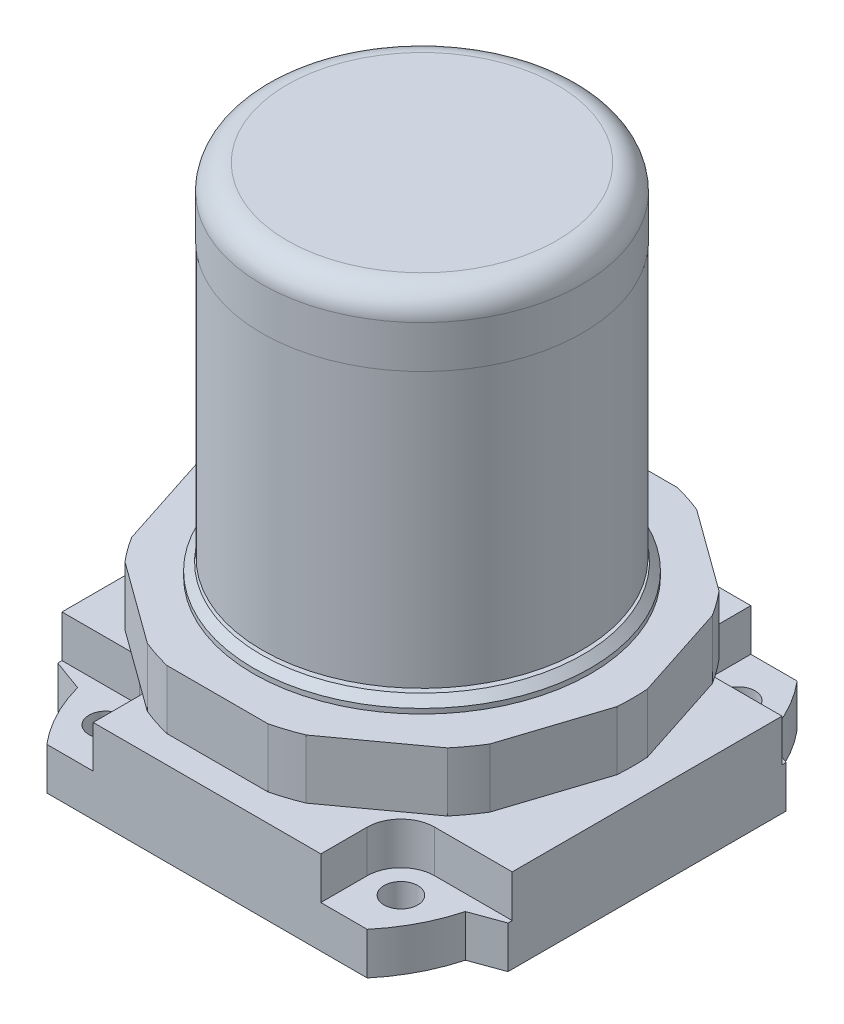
from build123d import *

# Parameters (mm, degrees)
SKETCH_1_R          = 2
EXTRUDE_1_DEPTH     = 10
CUT_EXTRUDE_1_DEPTH = 5
CUT_EXTRUDE_2_DEPTH = 5
CUT_EXTRUDE_3_DEPTH = 5
CUT_EXTRUDE_4_DEPTH = 5
SKETCH_8_R          = 50
CUT_EXTRUDE_5_DEPTH = 9


with BuildPart() as part:
    # Sketch 1 → Extrude 1 (new body)
    with BuildSketch(Plane(origin=(0, 0, 0), x_dir=(1, 0, 0), z_dir=(0, 1, 0))):
        with BuildLine():
            Line((-26.7, 16.5), (-26.7, -16.5))
            Line((-26.7, -16.5), (-23, -17.846689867))
            ThreePointArc((-23, -17.846689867), (-21.41799571, -21.891810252), (-19, -25.5))
            Line((-19, -25.5), (19, -25.5))
            ThreePointArc((19, -25.5), (21.41799571, -21.891810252), (23, -17.846689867))
            Line((23, -17.846689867), (26.7, -16.5))
            Line((26.7, -16.5), (26.7, 16.5))
            Line((26.7, 16.5), (23, 17.846689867))
            ThreePointArc((23, 17.846689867), (21.41799571, 21.891810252), (19, 25.5))
            Line((19, 25.5), (-19, 25.5))
            ThreePointArc((-19, 25.5), (-21.41799571, 21.891810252), (-23, 17.846689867))
            Line((-23, 17.846689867), (-26.7, 16.5))
        make_face()
        with Locations(Location((17.5, 20, 0), (0, 0, 270))):
            Circle(SKETCH_1_R, mode=Mode.SUBTRACT)
        with Locations(Location((17.5, -20, 0), (0, 0, 270))):
            Circle(SKETCH_1_R, mode=Mode.SUBTRACT)
        with Locations(Location((-17.5, 20, 0), (0, 0, 270))):
            Circle(SKETCH_1_R, mode=Mode.SUBTRACT)
        with Locations(Location((-17.5, -20, 0), (0, 0, 270))):
            Circle(SKETCH_1_R, mode=Mode.SUBTRACT)
    extrude(amount=EXTRUDE_1_DEPTH)

    # Sketch 2 → Cut-Extrude 1 (cut)
    with BuildSketch(Plane(origin=(0, 10, 0), x_dir=(1, 0, 0), z_dir=(0, 1, 0))):
        with BuildLine():
            Line((13.5, 25.5), (13.5, 20))
            ThreePointArc((13.5, 20), (14.671572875, 17.171572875), (17.5, 16))
            Line((17.5, 16), (26.7, 16))
            Line((26.7, 16), (26.7, 25.5))
            Line((26.7, 25.5), (13.5, 25.5))
        make_face()
    extrude(amount=-CUT_EXTRUDE_1_DEPTH, mode=Mode.SUBTRACT)

    # Sketch 3 → Cut-Extrude 2 (cut)
    with BuildSketch(Plane(origin=(0, 10, 0), x_dir=(1, 0, 0), z_dir=(0, 1, 0))):
        with BuildLine():
            Line((-26.7, 25.5), (-26.7, 16))
            Line((-26.7, 16), (-17.5, 16))
            ThreePointArc((-17.5, 16), (-14.671572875, 17.171572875), (-13.5, 20))
            Line((-13.5, 20), (-13.5, 25.5))
            Line((-13.5, 25.5), (-26.7, 25.5))
        make_face()
    extrude(amount=-CUT_EXTRUDE_2_DEPTH, mode=Mode.SUBTRACT)

    # Sketch 4 → Cut-Extrude 3 (cut)
    with BuildSketch(Plane(origin=(0, 10, 0), x_dir=(1, 0, 0), z_dir=(0, 1, 0))):
        with BuildLine():
            Line((13.5, -25.5), (26.7, -25.5))
            Line((26.7, -25.5), (26.7, -16))
            Line((26.7, -16), (17.5, -16))
            ThreePointArc((17.5, -16), (14.671572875, -17.171572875), (13.5, -20))
            Line((13.5, -20), (13.5, -25.5))
        make_face()
    extrude(amount=-CUT_EXTRUDE_3_DEPTH, mode=Mode.SUBTRACT)

    # Sketch 5 → Cut-Extrude 4 (cut)
    with BuildSketch(Plane(origin=(0, 10, 0), x_dir=(1, 0, 0), z_dir=(0, 1, 0))):
        with BuildLine():
            Line((-26.7, -25.5), (-13.5, -25.5))
            Line((-13.5, -25.5), (-13.5, -20))
            ThreePointArc((-13.5, -20), (-14.671572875, -17.171572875), (-17.5, -16))
            Line((-17.5, -16), (-26.7, -16))
            Line((-26.7, -16), (-26.7, -25.5))
        make_face()
    extrude(amount=-CUT_EXTRUDE_4_DEPTH, mode=Mode.SUBTRACT)

    # Sketch 6 → Revolve 1 (revolve)
    with BuildSketch(Plane(origin=(0, 0, 0), x_dir=(0, 0, -1), z_dir=(1, 0, 0)), mode=Mode.PRIVATE) as revolve_1_sk:
        with BuildLine():
            Line((0, 61.5), (16, 61.5))
            ThreePointArc((16, 61.5), (18.121320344, 60.621320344), (19, 58.5))
            Line((19, 58.5), (19, 53.47826087))
            Line((19, 53.47826087), (18.95, 53.47826087))
            Line((18.95, 53.47826087), (18.95, 20.9))
            Line((18.95, 20.9), (16.75, 20.9))
            Line((16.75, 20.9), (16.75, 20.5))
            Line((16.75, 20.5), (19.08, 20.5))
            Line((19.08, 20.5), (20, 19.58))
            Line((20, 19.58), (20, 10))
            Line((20, 10), (0, 10))
            Line((0, 10), (0, 61.5))
        make_face()
    revolve(revolve_1_sk.sketch.rotate(Axis((0, 10, 0), (0, 1, 0)), 180), axis=Axis((0, 10, 0), (0, 1, 0)))

    # Sketch 7 → Revolve 2 (revolve)
    with BuildSketch(Plane.XY, mode=Mode.PRIVATE) as revolve_2_sk:
        Polygon((19.188, 18.188), (19.188, 12.812), (20, 12), (25, 12), (25, 19), (20, 19), align=None)
    revolve(revolve_2_sk.sketch.rotate(Axis((0, 12, 0), (0, 1, 0)), 270), axis=Axis((0, 12, 0), (0, 1, 0)))

    # Sketch 8 → Cut-Extrude 5 (cut)
    with BuildSketch(Plane(origin=(0, 10, 0), x_dir=(1, 0, 0), z_dir=(0, 1, 0))):
        Circle(SKETCH_8_R)
        with BuildLine():
            Line((-25.059855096, -1.419035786), (-21.107936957, -13.581789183))
            ThreePointArc((-21.107936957, -13.581789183), (-20.306326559, -14.753409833), (-19.439760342, -15.877837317))
            Line((-19.439760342, -15.877837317), (-9.093504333, -23.394832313))
            ThreePointArc((-9.093504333, -23.394832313), (-7.756326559, -23.871518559), (-6.39433787, -24.27184466))
            Line((-6.39433787, -24.27184466), (6.39433787, -24.27184466))
            ThreePointArc((6.39433787, -24.27184466), (7.756326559, -23.871518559), (9.093504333, -23.394832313))
            Line((9.093504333, -23.394832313), (19.439760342, -15.877837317))
            ThreePointArc((19.439760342, -15.877837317), (20.306326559, -14.753409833), (21.107936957, -13.581789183))
            Line((21.107936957, -13.581789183), (25.059855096, -1.419035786))
            ThreePointArc((25.059855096, -1.419035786), (25.1, 0), (25.059855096, 1.419035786))
            Line((25.059855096, 1.419035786), (21.107936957, 13.581789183))
            ThreePointArc((21.107936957, 13.581789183), (20.306326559, 14.753409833), (19.439760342, 15.877837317))
            Line((19.439760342, 15.877837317), (9.093504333, 23.394832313))
            ThreePointArc((9.093504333, 23.394832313), (7.756326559, 23.871518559), (6.39433787, 24.27184466))
            Line((6.39433787, 24.27184466), (-6.39433787, 24.27184466))
            ThreePointArc((-6.39433787, 24.27184466), (-7.756326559, 23.871518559), (-9.093504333, 23.394832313))
            Line((-9.093504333, 23.394832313), (-19.439760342, 15.877837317))
            ThreePointArc((-19.439760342, 15.877837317), (-20.306326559, 14.753409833), (-21.107936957, 13.581789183))
            Line((-21.107936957, 13.581789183), (-25.059855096, 1.419035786))
            ThreePointArc((-25.059855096, 1.419035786), (-25.1, 0), (-25.059855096, -1.419035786))
        make_face(mode=Mode.SUBTRACT)
    extrude(amount=CUT_EXTRUDE_5_DEPTH, mode=Mode.SUBTRACT)


solid = part.part
